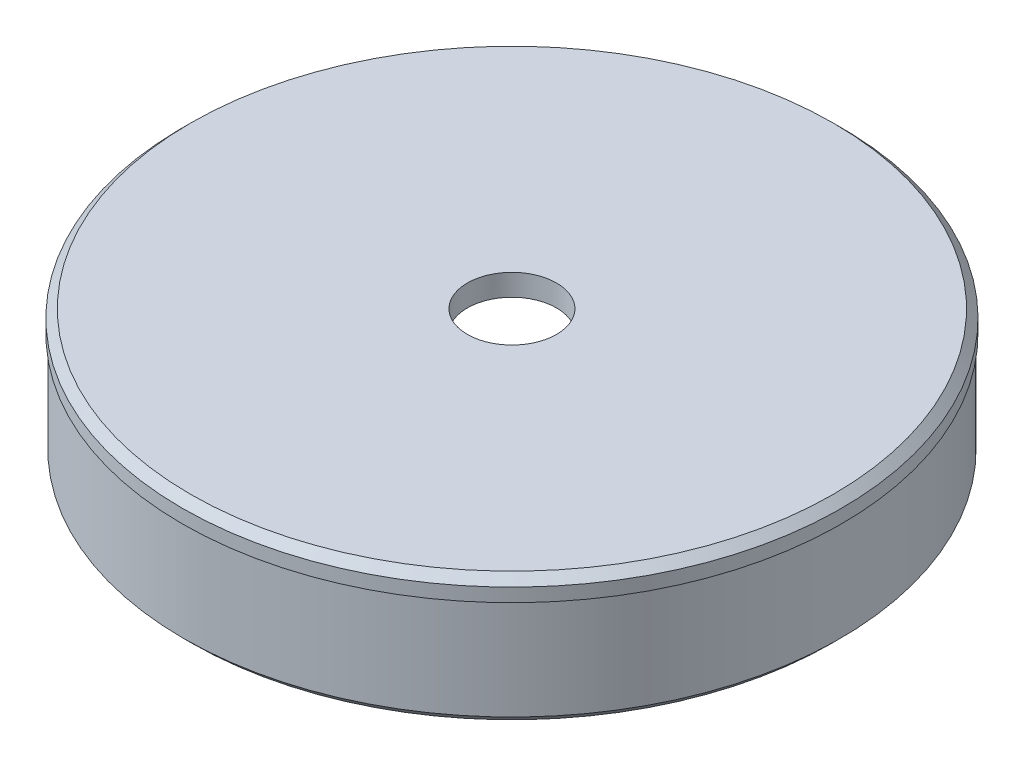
ISO-10303-21;
HEADER;
FILE_DESCRIPTION(('STEP AP214'),'2;1');
FILE_NAME('part.step','',(''),(''),'','','');
FILE_SCHEMA(('AUTOMOTIVE_DESIGN { 1 0 10303 214 1 1 1 1 }'));
ENDSEC;
DATA;
#1=APPLICATION_CONTEXT('core data for automotive mechanical design processes');
#2=APPLICATION_PROTOCOL_DEFINITION('international standard','automotive_design',2000,#1);
#3=PRODUCT_CONTEXT('',#1,'mechanical');
#4=PRODUCT('Part','Part','',(#3));
#5=PRODUCT_RELATED_PRODUCT_CATEGORY('part','',(#4));
#6=PRODUCT_DEFINITION_FORMATION('','',#4);
#7=PRODUCT_DEFINITION_CONTEXT('part definition',#1,'design');
#8=PRODUCT_DEFINITION('design','',#6,#7);
#9=PRODUCT_DEFINITION_SHAPE('','',#8);
#10=(LENGTH_UNIT() NAMED_UNIT(*) SI_UNIT(.MILLI.,.METRE.));
#11=(NAMED_UNIT(*) PLANE_ANGLE_UNIT() SI_UNIT($,.RADIAN.));
#12=(NAMED_UNIT(*) SI_UNIT($,.STERADIAN.) SOLID_ANGLE_UNIT());
#13=UNCERTAINTY_MEASURE_WITH_UNIT(LENGTH_MEASURE(1.E-05),#10,'distance_accuracy_value','');
#14=(GEOMETRIC_REPRESENTATION_CONTEXT(3) GLOBAL_UNCERTAINTY_ASSIGNED_CONTEXT((#13)) GLOBAL_UNIT_ASSIGNED_CONTEXT((#10,
#11,#12)) REPRESENTATION_CONTEXT('',''));
#15=CARTESIAN_POINT('',(0.,0.,0.));
#16=DIRECTION('',(0.,0.,1.));
#17=DIRECTION('',(1.,0.,0.));
#18=AXIS2_PLACEMENT_3D('',#15,#16,#17);
#19=CARTESIAN_POINT('',(0.,4.8,0.));
#20=DIRECTION('',(0.,-1.,0.));
#21=DIRECTION('',(0.,0.,-1.));
#22=AXIS2_PLACEMENT_3D('',#19,#20,#21);
#23=CYLINDRICAL_SURFACE('',#22,12.2);
#24=CARTESIAN_POINT('',(0.,4.49999999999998,0.));
#25=DIRECTION('',(0.,1.,0.));
#26=DIRECTION('',(0.,0.,1.));
#27=AXIS2_PLACEMENT_3D('',#24,#25,#26);
#28=CIRCLE('',#27,12.2);
#29=CARTESIAN_POINT('',(0.,4.49999999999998,12.2));
#30=VERTEX_POINT('',#29);
#31=EDGE_CURVE('E69',#30,#30,#28,.F.);
#32=ORIENTED_EDGE('',*,*,#31,.T.);
#33=EDGE_LOOP('',(#32));
#34=FACE_BOUND('',#33,.T.);
#35=CARTESIAN_POINT('',(0.,4.,0.));
#36=DIRECTION('',(0.,1.,0.));
#37=DIRECTION('',(0.,0.,1.));
#38=AXIS2_PLACEMENT_3D('',#35,#36,#37);
#39=CIRCLE('',#38,12.2);
#40=CARTESIAN_POINT('',(0.,4.,12.2));
#41=VERTEX_POINT('',#40);
#42=EDGE_CURVE('E82',#41,#41,#39,.T.);
#43=ORIENTED_EDGE('',*,*,#42,.T.);
#44=EDGE_LOOP('',(#43));
#45=FACE_BOUND('',#44,.T.);
#46=ADVANCED_FACE('F37',(#34,#45),#23,.T.);
#47=CARTESIAN_POINT('',(0.,4.8,0.));
#48=DIRECTION('',(0.,1.,0.));
#49=DIRECTION('',(0.,0.,1.));
#50=AXIS2_PLACEMENT_3D('',#47,#48,#49);
#51=PLANE('',#50);
#52=CARTESIAN_POINT('',(0.,4.8,0.));
#53=DIRECTION('',(0.,1.,0.));
#54=DIRECTION('',(0.,0.,1.));
#55=AXIS2_PLACEMENT_3D('',#52,#53,#54);
#56=CIRCLE('',#55,11.9);
#57=CARTESIAN_POINT('',(0.,4.8,11.9));
#58=VERTEX_POINT('',#57);
#59=EDGE_CURVE('E73',#58,#58,#56,.T.);
#60=ORIENTED_EDGE('',*,*,#59,.T.);
#61=EDGE_LOOP('',(#60));
#62=FACE_BOUND('',#61,.T.);
#63=CARTESIAN_POINT('',(0.,4.8,0.));
#64=DIRECTION('',(0.,1.,0.));
#65=DIRECTION('',(0.,0.,1.));
#66=AXIS2_PLACEMENT_3D('',#63,#64,#65);
#67=CIRCLE('',#66,1.65);
#68=CARTESIAN_POINT('',(0.,4.8,1.65));
#69=VERTEX_POINT('',#68);
#70=EDGE_CURVE('E78',#69,#69,#67,.T.);
#71=ORIENTED_EDGE('',*,*,#70,.F.);
#72=EDGE_LOOP('',(#71));
#73=FACE_BOUND('',#72,.T.);
#74=ADVANCED_FACE('F115',(#62,#73),#51,.T.);
#75=CARTESIAN_POINT('',(0.,4.,0.));
#76=DIRECTION('',(0.,1.,0.));
#77=DIRECTION('',(0.,0.,1.));
#78=AXIS2_PLACEMENT_3D('',#75,#76,#77);
#79=PLANE('',#78);
#80=CARTESIAN_POINT('',(0.,4.,0.));
#81=DIRECTION('',(0.,1.,0.));
#82=DIRECTION('',(0.,0.,1.));
#83=AXIS2_PLACEMENT_3D('',#80,#81,#82);
#84=CIRCLE('',#83,12.15);
#85=CARTESIAN_POINT('',(0.,4.,12.15));
#86=VERTEX_POINT('',#85);
#87=EDGE_CURVE('E77',#86,#86,#84,.F.);
#88=ORIENTED_EDGE('',*,*,#87,.F.);
#89=EDGE_LOOP('',(#88));
#90=FACE_BOUND('',#89,.T.);
#91=ORIENTED_EDGE('',*,*,#42,.F.);
#92=EDGE_LOOP('',(#91));
#93=FACE_BOUND('',#92,.T.);
#94=ADVANCED_FACE('F100',(#90,#93),#79,.F.);
#95=CARTESIAN_POINT('',(0.,0.,0.));
#96=DIRECTION('',(0.,1.,0.));
#97=DIRECTION('',(0.,0.,1.));
#98=AXIS2_PLACEMENT_3D('',#95,#96,#97);
#99=PLANE('',#98);
#100=CARTESIAN_POINT('',(0.,0.,0.));
#101=DIRECTION('',(0.,1.,0.));
#102=DIRECTION('',(0.,0.,1.));
#103=AXIS2_PLACEMENT_3D('',#100,#101,#102);
#104=CIRCLE('',#103,11.85);
#105=CARTESIAN_POINT('',(0.,0.,11.85));
#106=VERTEX_POINT('',#105);
#107=EDGE_CURVE('E55',#106,#106,#104,.F.);
#108=ORIENTED_EDGE('',*,*,#107,.T.);
#109=EDGE_LOOP('',(#108));
#110=FACE_BOUND('',#109,.T.);
#111=CARTESIAN_POINT('',(0.,0.,0.));
#112=DIRECTION('',(0.,1.,0.));
#113=DIRECTION('',(0.,0.,1.));
#114=AXIS2_PLACEMENT_3D('',#111,#112,#113);
#115=CIRCLE('',#114,10.45);
#116=CARTESIAN_POINT('',(0.,0.,10.45));
#117=VERTEX_POINT('',#116);
#118=EDGE_CURVE('E61',#117,#117,#115,.T.);
#119=ORIENTED_EDGE('',*,*,#118,.T.);
#120=EDGE_LOOP('',(#119));
#121=FACE_BOUND('',#120,.T.);
#122=ADVANCED_FACE('F114',(#110,#121),#99,.F.);
#123=CARTESIAN_POINT('',(0.,4.,0.));
#124=DIRECTION('',(0.,-1.,0.));
#125=DIRECTION('',(0.,0.,-1.));
#126=AXIS2_PLACEMENT_3D('',#123,#124,#125);
#127=CYLINDRICAL_SURFACE('',#126,12.15);
#128=CARTESIAN_POINT('',(0.,0.3,0.));
#129=DIRECTION('',(0.,1.,0.));
#130=DIRECTION('',(0.,0.,1.));
#131=AXIS2_PLACEMENT_3D('',#128,#129,#130);
#132=CIRCLE('',#131,12.15);
#133=CARTESIAN_POINT('',(0.,0.3,12.15));
#134=VERTEX_POINT('',#133);
#135=EDGE_CURVE('E65',#134,#134,#132,.T.);
#136=ORIENTED_EDGE('',*,*,#135,.T.);
#137=EDGE_LOOP('',(#136));
#138=FACE_BOUND('',#137,.T.);
#139=ORIENTED_EDGE('',*,*,#87,.T.);
#140=EDGE_LOOP('',(#139));
#141=FACE_BOUND('',#140,.T.);
#142=ADVANCED_FACE('F109',(#138,#141),#127,.T.);
#143=CARTESIAN_POINT('',(0.,4.,0.));
#144=DIRECTION('',(0.,-1.,0.));
#145=DIRECTION('',(0.,0.,-1.));
#146=AXIS2_PLACEMENT_3D('',#143,#144,#145);
#147=CYLINDRICAL_SURFACE('',#146,10.15);
#148=CARTESIAN_POINT('',(0.,3.7,0.));
#149=DIRECTION('',(0.,1.,0.));
#150=DIRECTION('',(0.,0.,1.));
#151=AXIS2_PLACEMENT_3D('',#148,#149,#150);
#152=CIRCLE('',#151,10.15);
#153=CARTESIAN_POINT('',(0.,3.7,10.15));
#154=VERTEX_POINT('',#153);
#155=EDGE_CURVE('E45',#154,#154,#152,.T.);
#156=ORIENTED_EDGE('',*,*,#155,.T.);
#157=EDGE_LOOP('',(#156));
#158=FACE_BOUND('',#157,.T.);
#159=CARTESIAN_POINT('',(0.,0.3,0.));
#160=DIRECTION('',(0.,1.,0.));
#161=DIRECTION('',(0.,0.,1.));
#162=AXIS2_PLACEMENT_3D('',#159,#160,#161);
#163=CIRCLE('',#162,10.15);
#164=CARTESIAN_POINT('',(0.,0.3,10.15));
#165=VERTEX_POINT('',#164);
#166=EDGE_CURVE('E50',#165,#165,#163,.F.);
#167=ORIENTED_EDGE('',*,*,#166,.T.);
#168=EDGE_LOOP('',(#167));
#169=FACE_BOUND('',#168,.T.);
#170=ADVANCED_FACE('F98',(#158,#169),#147,.F.);
#171=CARTESIAN_POINT('',(0.,4.,0.));
#172=DIRECTION('',(0.,1.,0.));
#173=DIRECTION('',(0.,0.,1.));
#174=AXIS2_PLACEMENT_3D('',#171,#172,#173);
#175=CIRCLE('',#174,9.85);
#176=CARTESIAN_POINT('',(0.,4.,9.85));
#177=VERTEX_POINT('',#176);
#178=EDGE_CURVE('E10',#177,#177,#175,.F.);
#179=ORIENTED_EDGE('',*,*,#178,.T.);
#180=EDGE_LOOP('',(#179));
#181=FACE_BOUND('',#180,.T.);
#182=CARTESIAN_POINT('',(0.,4.,0.));
#183=DIRECTION('',(0.,-1.,0.));
#184=DIRECTION('',(0.,0.,-1.));
#185=AXIS2_PLACEMENT_3D('',#182,#183,#184);
#186=CIRCLE('',#185,1.65);
#187=CARTESIAN_POINT('',(0.,4.,-1.65));
#188=VERTEX_POINT('',#187);
#189=EDGE_CURVE('E83',#188,#188,#186,.T.);
#190=ORIENTED_EDGE('',*,*,#189,.F.);
#191=EDGE_LOOP('',(#190));
#192=FACE_BOUND('',#191,.T.);
#193=ADVANCED_FACE('F96',(#181,#192),#79,.F.);
#194=CARTESIAN_POINT('',(0.,14.,0.));
#195=DIRECTION('',(0.,-1.,0.));
#196=DIRECTION('',(0.,0.,-1.));
#197=AXIS2_PLACEMENT_3D('',#194,#195,#196);
#198=CYLINDRICAL_SURFACE('',#197,1.65);
#199=ORIENTED_EDGE('',*,*,#70,.T.);
#200=EDGE_LOOP('',(#199));
#201=FACE_BOUND('',#200,.T.);
#202=ORIENTED_EDGE('',*,*,#189,.T.);
#203=EDGE_LOOP('',(#202));
#204=FACE_BOUND('',#203,.T.);
#205=ADVANCED_FACE('F94',(#201,#204),#198,.F.);
#206=CARTESIAN_POINT('',(0.,4.8,0.));
#207=DIRECTION('',(0.,-1.,0.));
#208=DIRECTION('',(0.,0.,-1.));
#209=AXIS2_PLACEMENT_3D('',#206,#207,#208);
#210=CONICAL_SURFACE('',#209,11.9,0.785398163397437);
#211=ORIENTED_EDGE('',*,*,#31,.F.);
#212=EDGE_LOOP('',(#211));
#213=FACE_BOUND('',#212,.T.);
#214=ORIENTED_EDGE('',*,*,#59,.F.);
#215=EDGE_LOOP('',(#214));
#216=FACE_BOUND('',#215,.T.);
#217=ADVANCED_FACE('F106',(#213,#216),#210,.T.);
#218=CARTESIAN_POINT('',(0.,0.3,0.));
#219=DIRECTION('',(0.,1.,0.));
#220=DIRECTION('',(0.,0.,1.));
#221=AXIS2_PLACEMENT_3D('',#218,#219,#220);
#222=CONICAL_SURFACE('',#221,12.15,0.785398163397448);
#223=ORIENTED_EDGE('',*,*,#107,.F.);
#224=EDGE_LOOP('',(#223));
#225=FACE_BOUND('',#224,.T.);
#226=ORIENTED_EDGE('',*,*,#135,.F.);
#227=EDGE_LOOP('',(#226));
#228=FACE_BOUND('',#227,.T.);
#229=ADVANCED_FACE('F128',(#225,#228),#222,.T.);
#230=CARTESIAN_POINT('',(0.,3.7,0.));
#231=DIRECTION('',(0.,-1.,0.));
#232=DIRECTION('',(0.,0.,-1.));
#233=AXIS2_PLACEMENT_3D('',#230,#231,#232);
#234=CONICAL_SURFACE('',#233,10.15,0.785398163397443);
#235=ORIENTED_EDGE('',*,*,#178,.F.);
#236=EDGE_LOOP('',(#235));
#237=FACE_BOUND('',#236,.T.);
#238=ORIENTED_EDGE('',*,*,#155,.F.);
#239=EDGE_LOOP('',(#238));
#240=FACE_BOUND('',#239,.T.);
#241=ADVANCED_FACE('F131',(#237,#240),#234,.F.);
#242=CARTESIAN_POINT('',(0.,0.,0.));
#243=DIRECTION('',(0.,-1.,0.));
#244=DIRECTION('',(0.,0.,-1.));
#245=AXIS2_PLACEMENT_3D('',#242,#243,#244);
#246=CONICAL_SURFACE('',#245,10.45,0.785398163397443);
#247=ORIENTED_EDGE('',*,*,#166,.F.);
#248=EDGE_LOOP('',(#247));
#249=FACE_BOUND('',#248,.T.);
#250=ORIENTED_EDGE('',*,*,#118,.F.);
#251=EDGE_LOOP('',(#250));
#252=FACE_BOUND('',#251,.T.);
#253=ADVANCED_FACE('F39',(#249,#252),#246,.F.);
#254=CLOSED_SHELL('',(#46,#74,#94,#122,#142,#170,#193,#205,#217,#229,#241,#253));
#255=MANIFOLD_SOLID_BREP('B2',#254);
#256=ADVANCED_BREP_SHAPE_REPRESENTATION('',(#18,#255),#14);
#257=SHAPE_DEFINITION_REPRESENTATION(#9,#256);
ENDSEC;
END-ISO-10303-21;
